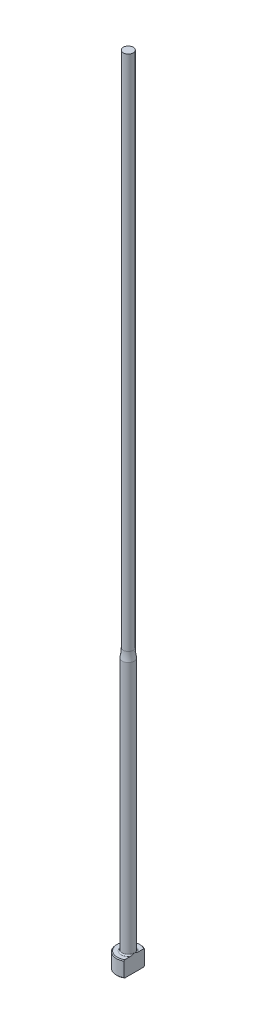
ISO-10303-21;
HEADER;
FILE_DESCRIPTION(('STEP AP214'),'2;1');
FILE_NAME('part.step','',(''),(''),'','','');
FILE_SCHEMA(('AUTOMOTIVE_DESIGN { 1 0 10303 214 1 1 1 1 }'));
ENDSEC;
DATA;
#1=APPLICATION_CONTEXT('core data for automotive mechanical design processes');
#2=APPLICATION_PROTOCOL_DEFINITION('international standard','automotive_design',2000,#1);
#3=PRODUCT_CONTEXT('',#1,'mechanical');
#4=PRODUCT('Part','Part','',(#3));
#5=PRODUCT_RELATED_PRODUCT_CATEGORY('part','',(#4));
#6=PRODUCT_DEFINITION_FORMATION('','',#4);
#7=PRODUCT_DEFINITION_CONTEXT('part definition',#1,'design');
#8=PRODUCT_DEFINITION('design','',#6,#7);
#9=PRODUCT_DEFINITION_SHAPE('','',#8);
#10=(LENGTH_UNIT() NAMED_UNIT(*) SI_UNIT(.MILLI.,.METRE.));
#11=(NAMED_UNIT(*) PLANE_ANGLE_UNIT() SI_UNIT($,.RADIAN.));
#12=(NAMED_UNIT(*) SI_UNIT($,.STERADIAN.) SOLID_ANGLE_UNIT());
#13=UNCERTAINTY_MEASURE_WITH_UNIT(LENGTH_MEASURE(1.E-05),#10,'distance_accuracy_value','');
#14=(GEOMETRIC_REPRESENTATION_CONTEXT(3) GLOBAL_UNCERTAINTY_ASSIGNED_CONTEXT((#13)) GLOBAL_UNIT_ASSIGNED_CONTEXT((#10,
#11,#12)) REPRESENTATION_CONTEXT('',''));
#15=CARTESIAN_POINT('',(0.,0.,0.));
#16=DIRECTION('',(0.,0.,1.));
#17=DIRECTION('',(1.,0.,0.));
#18=AXIS2_PLACEMENT_3D('',#15,#16,#17);
#19=CARTESIAN_POINT('',(-2.99999999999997,4.,0.));
#20=DIRECTION('',(0.,1.,0.));
#21=DIRECTION('',(0.,0.,1.));
#22=AXIS2_PLACEMENT_3D('',#19,#20,#21);
#23=PLANE('',#22);
#24=CARTESIAN_POINT('',(0.,4.,0.));
#25=DIRECTION('',(0.,1.,0.));
#26=DIRECTION('',(0.,0.,1.));
#27=AXIS2_PLACEMENT_3D('',#24,#25,#26);
#28=CIRCLE('',#27,2.79999999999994);
#29=CARTESIAN_POINT('',(1.49999999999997,4.,-2.36431808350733));
#30=VERTEX_POINT('',#29);
#31=CARTESIAN_POINT('',(1.49999999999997,4.,2.36431808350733));
#32=VERTEX_POINT('',#31);
#33=EDGE_CURVE('E187',#30,#32,#28,.T.);
#34=ORIENTED_EDGE('',*,*,#33,.T.);
#35=DIRECTION('',(0.,0.,-1.));
#36=VECTOR('',#35,1.);
#37=CARTESIAN_POINT('',(1.49999999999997,4.,0.));
#38=LINE('',#37,#36);
#39=CARTESIAN_POINT('',(1.49999999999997,4.00000000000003,0.994987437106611));
#40=VERTEX_POINT('',#39);
#41=EDGE_CURVE('E57',#32,#40,#38,.T.);
#42=ORIENTED_EDGE('',*,*,#41,.T.);
#43=CARTESIAN_POINT('',(0.,4.,0.));
#44=DIRECTION('',(0.,1.,0.));
#45=DIRECTION('',(0.,0.,1.));
#46=AXIS2_PLACEMENT_3D('',#43,#44,#45);
#47=CIRCLE('',#46,1.79999999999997);
#48=CARTESIAN_POINT('',(1.49999999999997,4.00000000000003,-0.994987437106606));
#49=VERTEX_POINT('',#48);
#50=EDGE_CURVE('E108',#40,#49,#47,.F.);
#51=ORIENTED_EDGE('',*,*,#50,.T.);
#52=EDGE_CURVE('E137',#49,#30,#38,.T.);
#53=ORIENTED_EDGE('',*,*,#52,.T.);
#54=EDGE_LOOP('',(#34,#42,#51,#53));
#55=FACE_BOUND('',#54,.T.);
#56=ADVANCED_FACE('F32',(#55),#23,.T.);
#57=CARTESIAN_POINT('',(0.,259.958771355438,0.));
#58=DIRECTION('',(0.,1.,0.));
#59=DIRECTION('',(0.,0.,1.));
#60=AXIS2_PLACEMENT_3D('',#57,#58,#59);
#61=CYLINDRICAL_SURFACE('',#60,2.99999999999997);
#62=CARTESIAN_POINT('',(0.,3.79999999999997,0.));
#63=DIRECTION('',(0.,1.,0.));
#64=DIRECTION('',(0.,0.,1.));
#65=AXIS2_PLACEMENT_3D('',#62,#63,#64);
#66=CIRCLE('',#65,2.99999999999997);
#67=CARTESIAN_POINT('',(1.49999999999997,3.79999999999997,2.5980762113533));
#68=VERTEX_POINT('',#67);
#69=CARTESIAN_POINT('',(1.49999999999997,3.79999999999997,-2.5980762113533));
#70=VERTEX_POINT('',#69);
#71=EDGE_CURVE('E105',#68,#70,#66,.F.);
#72=ORIENTED_EDGE('',*,*,#71,.T.);
#73=DIRECTION('',(0.,-1.,0.));
#74=VECTOR('',#73,1.);
#75=CARTESIAN_POINT('',(1.49999999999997,200.,-2.5980762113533));
#76=LINE('',#75,#74);
#77=CARTESIAN_POINT('',(1.49999999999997,0.200000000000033,-2.5980762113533));
#78=VERTEX_POINT('',#77);
#79=EDGE_CURVE('E193',#70,#78,#76,.T.);
#80=ORIENTED_EDGE('',*,*,#79,.T.);
#81=CARTESIAN_POINT('',(0.,0.200000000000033,0.));
#82=DIRECTION('',(0.,-1.,0.));
#83=DIRECTION('',(0.,0.,-1.));
#84=AXIS2_PLACEMENT_3D('',#81,#82,#83);
#85=CIRCLE('',#84,2.99999999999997);
#86=CARTESIAN_POINT('',(1.49999999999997,0.200000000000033,2.5980762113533));
#87=VERTEX_POINT('',#86);
#88=EDGE_CURVE('E100',#78,#87,#85,.F.);
#89=ORIENTED_EDGE('',*,*,#88,.T.);
#90=DIRECTION('',(0.,-1.,0.));
#91=VECTOR('',#90,1.);
#92=CARTESIAN_POINT('',(1.49999999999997,200.,2.5980762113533));
#93=LINE('',#92,#91);
#94=EDGE_CURVE('E93',#68,#87,#93,.T.);
#95=ORIENTED_EDGE('',*,*,#94,.F.);
#96=EDGE_LOOP('',(#72,#80,#89,#95));
#97=FACE_BOUND('',#96,.T.);
#98=ADVANCED_FACE('F158',(#97),#61,.T.);
#99=CARTESIAN_POINT('',(0.,0.,0.));
#100=DIRECTION('',(0.,-1.,0.));
#101=DIRECTION('',(0.,0.,-1.));
#102=AXIS2_PLACEMENT_3D('',#99,#100,#101);
#103=PLANE('',#102);
#104=CARTESIAN_POINT('',(0.,0.,0.));
#105=DIRECTION('',(0.,-1.,0.));
#106=DIRECTION('',(0.,0.,-1.));
#107=AXIS2_PLACEMENT_3D('',#104,#105,#106);
#108=CIRCLE('',#107,2.79999999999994);
#109=CARTESIAN_POINT('',(1.49999999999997,0.,2.36431808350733));
#110=VERTEX_POINT('',#109);
#111=CARTESIAN_POINT('',(1.49999999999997,0.,-2.36431808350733));
#112=VERTEX_POINT('',#111);
#113=EDGE_CURVE('E98',#110,#112,#108,.T.);
#114=ORIENTED_EDGE('',*,*,#113,.T.);
#115=DIRECTION('',(0.,0.,1.));
#116=VECTOR('',#115,1.);
#117=CARTESIAN_POINT('',(1.49999999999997,0.,2.5980762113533));
#118=LINE('',#117,#116);
#119=EDGE_CURVE('E83',#112,#110,#118,.T.);
#120=ORIENTED_EDGE('',*,*,#119,.T.);
#121=EDGE_LOOP('',(#114,#120));
#122=FACE_BOUND('',#121,.T.);
#123=ADVANCED_FACE('F103',(#122),#103,.T.);
#124=CARTESIAN_POINT('',(0.,4.,0.));
#125=DIRECTION('',(0.,-1.,0.));
#126=DIRECTION('',(0.,0.,-1.));
#127=AXIS2_PLACEMENT_3D('',#124,#125,#126);
#128=CONICAL_SURFACE('',#127,2.79999999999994,0.785398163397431);
#129=ORIENTED_EDGE('',*,*,#71,.F.);
#130=CARTESIAN_POINT('',(1.49999999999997,0.888258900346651,5.71827621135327));
#131=CARTESIAN_POINT('',(1.49999999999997,1.01361833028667,5.58866816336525));
#132=CARTESIAN_POINT('',(1.49999999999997,1.13884324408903,5.45892957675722));
#133=CARTESIAN_POINT('',(1.49999999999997,1.38894444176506,5.19911365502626));
#134=CARTESIAN_POINT('',(1.49999999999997,1.51382072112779,5.06903631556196));
#135=CARTESIAN_POINT('',(1.49999999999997,1.76320568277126,4.80840180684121));
#136=CARTESIAN_POINT('',(1.49999999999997,1.88771414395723,4.67784442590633));
#137=CARTESIAN_POINT('',(1.49999999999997,2.13618059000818,4.4162081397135));
#138=CARTESIAN_POINT('',(1.49999999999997,2.26013857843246,4.28512923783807));
#139=CARTESIAN_POINT('',(1.49999999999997,2.50488975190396,4.02490837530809));
#140=CARTESIAN_POINT('',(1.49999999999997,2.62569693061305,3.8957795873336));
#141=CARTESIAN_POINT('',(1.49999999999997,2.86640694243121,3.63668213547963));
#142=CARTESIAN_POINT('',(1.49999999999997,2.98630978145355,3.50671347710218));
#143=CARTESIAN_POINT('',(1.49999999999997,3.22486033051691,3.24567921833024));
#144=CARTESIAN_POINT('',(1.49999999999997,3.3435083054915,3.11461386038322));
#145=CARTESIAN_POINT('',(1.49999999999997,3.5790771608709,2.85094268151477));
#146=CARTESIAN_POINT('',(1.49999999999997,3.69599811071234,2.71833692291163));
#147=CARTESIAN_POINT('',(1.49999999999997,3.88262371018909,2.50255231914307));
#148=CARTESIAN_POINT('',(1.49999999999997,3.95312454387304,2.42006293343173));
#149=CARTESIAN_POINT('',(1.49999999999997,4.09287098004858,2.254010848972));
#150=CARTESIAN_POINT('',(1.49999999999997,4.16211645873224,2.17044804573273));
#151=CARTESIAN_POINT('',(1.49999999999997,4.29964684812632,2.00105967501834));
#152=CARTESIAN_POINT('',(1.49999999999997,4.36791386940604,1.9152195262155));
#153=CARTESIAN_POINT('',(1.49999999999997,4.50205840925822,1.7417139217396));
#154=CARTESIAN_POINT('',(1.49999999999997,4.56793649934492,1.65404891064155));
#155=CARTESIAN_POINT('',(1.49999999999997,4.69728151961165,1.47490236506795));
#156=CARTESIAN_POINT('',(1.49999999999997,4.76069661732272,1.38338308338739));
#157=CARTESIAN_POINT('',(1.49999999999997,4.88239539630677,1.19675661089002));
#158=CARTESIAN_POINT('',(1.49999999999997,4.94067201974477,1.10164473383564));
#159=CARTESIAN_POINT('',(1.49999999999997,5.048413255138,0.908008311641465));
#160=CARTESIAN_POINT('',(1.49999999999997,5.09797809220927,0.809540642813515));
#161=CARTESIAN_POINT('',(1.49999999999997,5.18432188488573,0.607192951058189));
#162=CARTESIAN_POINT('',(1.49999999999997,5.22114374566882,0.50333247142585));
#163=CARTESIAN_POINT('',(1.49999999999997,5.26099935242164,0.347577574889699));
#164=CARTESIAN_POINT('',(1.49999999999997,5.2715702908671,0.297609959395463));
#165=CARTESIAN_POINT('',(1.49999999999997,5.28794860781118,0.196885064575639));
#166=CARTESIAN_POINT('',(1.49999999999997,5.29375640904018,0.146127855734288));
#167=CARTESIAN_POINT('',(1.49999999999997,5.30019707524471,0.0444388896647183));
#168=CARTESIAN_POINT('',(1.49999999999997,5.30084594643,-0.00649183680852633));
#169=CARTESIAN_POINT('',(1.49999999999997,5.29696416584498,-0.108155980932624));
#170=CARTESIAN_POINT('',(1.49999999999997,5.29243308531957,-0.158889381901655));
#171=CARTESIAN_POINT('',(1.49999999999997,5.27856915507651,-0.259234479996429));
#172=CARTESIAN_POINT('',(1.49999999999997,5.2692782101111,-0.308852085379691));
#173=CARTESIAN_POINT('',(1.49999999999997,5.24647108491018,-0.407110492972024));
#174=CARTESIAN_POINT('',(1.49999999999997,5.23295324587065,-0.45575090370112));
#175=CARTESIAN_POINT('',(1.49999999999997,5.20226175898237,-0.55214996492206));
#176=CARTESIAN_POINT('',(1.49999999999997,5.18506801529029,-0.599902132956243));
#177=CARTESIAN_POINT('',(1.49999999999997,5.1477138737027,-0.694205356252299));
#178=CARTESIAN_POINT('',(1.49999999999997,5.12755408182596,-0.740756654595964));
#179=CARTESIAN_POINT('',(1.49999999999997,5.0632769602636,-0.879166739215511));
#180=CARTESIAN_POINT('',(1.49999999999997,5.01551721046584,-0.969329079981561));
#181=CARTESIAN_POINT('',(1.49999999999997,4.91367909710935,-1.14604316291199));
#182=CARTESIAN_POINT('',(1.49999999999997,4.85959300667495,-1.2325903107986));
#183=CARTESIAN_POINT('',(1.49999999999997,4.74697968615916,-1.40321348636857));
#184=CARTESIAN_POINT('',(1.49999999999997,4.68843573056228,-1.4872783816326));
#185=CARTESIAN_POINT('',(1.49999999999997,4.5684384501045,-1.65322187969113));
#186=CARTESIAN_POINT('',(1.49999999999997,4.50698656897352,-1.73510153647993));
#187=CARTESIAN_POINT('',(1.49999999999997,4.3811567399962,-1.89829823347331));
#188=CARTESIAN_POINT('',(1.49999999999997,4.31675092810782,-1.97959369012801));
#189=CARTESIAN_POINT('',(1.49999999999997,4.18634068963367,-2.14090082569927));
#190=CARTESIAN_POINT('',(1.49999999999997,4.12033609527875,-2.22091236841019));
#191=CARTESIAN_POINT('',(1.49999999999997,3.92086431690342,-2.45906508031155));
#192=CARTESIAN_POINT('',(1.49999999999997,3.78562663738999,-2.61572090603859));
#193=CARTESIAN_POINT('',(1.49999999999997,3.53554498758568,-2.90006295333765));
#194=CARTESIAN_POINT('',(1.49999999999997,3.42114543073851,-3.02814382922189));
#195=CARTESIAN_POINT('',(1.49999999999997,3.1909355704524,-3.28303767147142));
#196=CARTESIAN_POINT('',(1.49999999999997,3.07512522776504,-3.40985060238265));
#197=CARTESIAN_POINT('',(1.49999999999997,2.72597067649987,-3.78913849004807));
#198=CARTESIAN_POINT('',(1.49999999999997,2.49111760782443,-4.04022177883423));
#199=CARTESIAN_POINT('',(1.49999999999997,2.0288247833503,-4.52992803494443));
#200=CARTESIAN_POINT('',(1.49999999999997,1.80147747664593,-4.7686387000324));
#201=CARTESIAN_POINT('',(1.49999999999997,1.45954865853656,-5.12558036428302));
#202=CARTESIAN_POINT('',(1.49999999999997,1.34548484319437,-5.24430773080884));
#203=CARTESIAN_POINT('',(1.49999999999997,1.11707176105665,-5.48148573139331));
#204=CARTESIAN_POINT('',(1.49999999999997,1.00272249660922,-5.59993636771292));
#205=CARTESIAN_POINT('',(1.49999999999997,0.888258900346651,-5.71827621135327));
#206=B_SPLINE_CURVE_WITH_KNOTS('',3,(#130,#131,#132,#133,#134,#135,#136,#137,#138,#139,#140,
#141,#142,#143,#144,#145,#146,#147,#148,#149,#150,#151,#152,#153,#154,#155,#156,#157,#158,#159,
#160,#161,#162,#163,#164,#165,#166,#167,#168,#169,#170,#171,#172,#173,#174,#175,#176,#177,#178,
#179,#180,#181,#182,#183,#184,#185,#186,#187,#188,#189,#190,#191,#192,#193,#194,#195,#196,#197,
#198,#199,#200,#201,#202,#203,#204,#205),.UNSPECIFIED.,.F.,.F.,(4,2,2,2,2,2,2,2,2,2,2,2,2,2,2,2,
2,2,2,2,2,2,2,2,2,2,2,2,2,2,2,2,2,2,2,2,2,4),(0.,0.540943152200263,1.08189327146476,
1.62312052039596,2.16434426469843,2.69482920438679,3.22531067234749,3.75567781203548,
4.28602356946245,4.611550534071,4.9371094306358,5.26610945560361,5.59503024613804,
5.92894782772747,6.26331713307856,6.59354403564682,6.92264800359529,7.07567478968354,
7.22868799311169,7.38122626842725,7.53377717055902,7.68500755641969,7.83629736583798,
7.988436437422,8.14054446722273,8.44618799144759,8.75220879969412,9.05944044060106,
9.36652111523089,9.6776428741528,9.98879742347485,10.609592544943,11.1247803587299,
11.6399825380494,12.6713544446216,13.6603005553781,14.1542238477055,14.6481430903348),.UNSPECIFIED.);
#207=EDGE_CURVE('E136',#68,#32,#206,.T.);
#208=ORIENTED_EDGE('',*,*,#207,.T.);
#209=ORIENTED_EDGE('',*,*,#33,.F.);
#210=EDGE_CURVE('E128',#30,#70,#206,.T.);
#211=ORIENTED_EDGE('',*,*,#210,.T.);
#212=EDGE_LOOP('',(#129,#208,#209,#211));
#213=FACE_BOUND('',#212,.T.);
#214=ADVANCED_FACE('F144',(#213),#128,.T.);
#215=CARTESIAN_POINT('',(0.,0.200000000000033,0.));
#216=DIRECTION('',(0.,1.,0.));
#217=DIRECTION('',(0.,0.,1.));
#218=AXIS2_PLACEMENT_3D('',#215,#216,#217);
#219=CONICAL_SURFACE('',#218,2.99999999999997,0.785398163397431);
#220=ORIENTED_EDGE('',*,*,#88,.F.);
#221=CARTESIAN_POINT('',(1.49999999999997,3.11174109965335,-5.71827621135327));
#222=CARTESIAN_POINT('',(1.49999999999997,2.98638166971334,-5.58866816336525));
#223=CARTESIAN_POINT('',(1.49999999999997,2.86115675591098,-5.45892957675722));
#224=CARTESIAN_POINT('',(1.49999999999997,2.61105555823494,-5.19911365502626));
#225=CARTESIAN_POINT('',(1.49999999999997,2.48617927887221,-5.06903631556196));
#226=CARTESIAN_POINT('',(1.49999999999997,2.23679431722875,-4.80840180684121));
#227=CARTESIAN_POINT('',(1.49999999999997,2.11228585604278,-4.67784442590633));
#228=CARTESIAN_POINT('',(1.49999999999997,1.86381940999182,-4.4162081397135));
#229=CARTESIAN_POINT('',(1.49999999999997,1.73986142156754,-4.28512923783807));
#230=CARTESIAN_POINT('',(1.49999999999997,1.49511024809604,-4.02490837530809));
#231=CARTESIAN_POINT('',(1.49999999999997,1.37430306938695,-3.8957795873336));
#232=CARTESIAN_POINT('',(1.49999999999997,1.13359305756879,-3.63668213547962));
#233=CARTESIAN_POINT('',(1.49999999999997,1.01369021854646,-3.50671347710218));
#234=CARTESIAN_POINT('',(1.49999999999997,0.775139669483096,-3.24567921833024));
#235=CARTESIAN_POINT('',(1.49999999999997,0.656491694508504,-3.11461386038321));
#236=CARTESIAN_POINT('',(1.49999999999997,0.420922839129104,-2.85094268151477));
#237=CARTESIAN_POINT('',(1.49999999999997,0.304001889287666,-2.71833692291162));
#238=CARTESIAN_POINT('',(1.49999999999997,0.117376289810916,-2.50255231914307));
#239=CARTESIAN_POINT('',(1.49999999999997,0.0468754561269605,-2.42006293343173));
#240=CARTESIAN_POINT('',(1.49999999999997,-0.0928709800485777,-2.254010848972));
#241=CARTESIAN_POINT('',(1.49999999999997,-0.162116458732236,-2.17044804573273));
#242=CARTESIAN_POINT('',(1.49999999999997,-0.299646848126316,-2.00105967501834));
#243=CARTESIAN_POINT('',(1.49999999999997,-0.367913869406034,-1.9152195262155));
#244=CARTESIAN_POINT('',(1.49999999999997,-0.502058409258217,-1.7417139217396));
#245=CARTESIAN_POINT('',(1.49999999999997,-0.567936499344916,-1.65404891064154));
#246=CARTESIAN_POINT('',(1.49999999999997,-0.697281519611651,-1.47490236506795));
#247=CARTESIAN_POINT('',(1.49999999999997,-0.760696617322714,-1.38338308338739));
#248=CARTESIAN_POINT('',(1.49999999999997,-0.882395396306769,-1.19675661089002));
#249=CARTESIAN_POINT('',(1.49999999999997,-0.940672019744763,-1.10164473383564));
#250=CARTESIAN_POINT('',(1.49999999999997,-1.048413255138,-0.908008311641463));
#251=CARTESIAN_POINT('',(1.49999999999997,-1.09797809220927,-0.809540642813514));
#252=CARTESIAN_POINT('',(1.49999999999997,-1.18432188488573,-0.607192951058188));
#253=CARTESIAN_POINT('',(1.49999999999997,-1.22114374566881,-0.503332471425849));
#254=CARTESIAN_POINT('',(1.49999999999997,-1.26099935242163,-0.347577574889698));
#255=CARTESIAN_POINT('',(1.49999999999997,-1.2715702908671,-0.297609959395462));
#256=CARTESIAN_POINT('',(1.49999999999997,-1.28794860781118,-0.196885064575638));
#257=CARTESIAN_POINT('',(1.49999999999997,-1.29375640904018,-0.146127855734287));
#258=CARTESIAN_POINT('',(1.49999999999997,-1.30019707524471,-0.0444388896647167));
#259=CARTESIAN_POINT('',(1.49999999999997,-1.30084594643,0.00649183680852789));
#260=CARTESIAN_POINT('',(1.49999999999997,-1.29696416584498,0.108155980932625));
#261=CARTESIAN_POINT('',(1.49999999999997,-1.29243308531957,0.158889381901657));
#262=CARTESIAN_POINT('',(1.49999999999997,-1.2785691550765,0.259234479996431));
#263=CARTESIAN_POINT('',(1.49999999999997,-1.2692782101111,0.308852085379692));
#264=CARTESIAN_POINT('',(1.49999999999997,-1.24647108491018,0.407110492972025));
#265=CARTESIAN_POINT('',(1.49999999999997,-1.23295324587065,0.455750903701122));
#266=CARTESIAN_POINT('',(1.49999999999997,-1.20226175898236,0.552149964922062));
#267=CARTESIAN_POINT('',(1.49999999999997,-1.18506801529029,0.599902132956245));
#268=CARTESIAN_POINT('',(1.49999999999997,-1.14771387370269,0.694205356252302));
#269=CARTESIAN_POINT('',(1.49999999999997,-1.12755408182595,0.740756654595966));
#270=CARTESIAN_POINT('',(1.49999999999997,-1.0632769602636,0.879166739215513));
#271=CARTESIAN_POINT('',(1.49999999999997,-1.01551721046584,0.969329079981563));
#272=CARTESIAN_POINT('',(1.49999999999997,-0.913679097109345,1.14604316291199));
#273=CARTESIAN_POINT('',(1.49999999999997,-0.859593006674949,1.2325903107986));
#274=CARTESIAN_POINT('',(1.49999999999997,-0.746979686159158,1.40321348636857));
#275=CARTESIAN_POINT('',(1.49999999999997,-0.688435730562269,1.4872783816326));
#276=CARTESIAN_POINT('',(1.49999999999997,-0.568438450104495,1.65322187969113));
#277=CARTESIAN_POINT('',(1.49999999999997,-0.506986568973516,1.73510153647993));
#278=CARTESIAN_POINT('',(1.49999999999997,-0.381156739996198,1.89829823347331));
#279=CARTESIAN_POINT('',(1.49999999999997,-0.316750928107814,1.97959369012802));
#280=CARTESIAN_POINT('',(1.49999999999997,-0.186340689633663,2.14090082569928));
#281=CARTESIAN_POINT('',(1.49999999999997,-0.12033609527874,2.22091236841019));
#282=CARTESIAN_POINT('',(1.49999999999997,0.0791356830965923,2.45906508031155));
#283=CARTESIAN_POINT('',(1.49999999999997,0.214373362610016,2.61572090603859));
#284=CARTESIAN_POINT('',(1.49999999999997,0.46445501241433,2.90006295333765));
#285=CARTESIAN_POINT('',(1.49999999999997,0.578854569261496,3.02814382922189));
#286=CARTESIAN_POINT('',(1.49999999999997,0.809064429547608,3.28303767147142));
#287=CARTESIAN_POINT('',(1.49999999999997,0.924874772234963,3.40985060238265));
#288=CARTESIAN_POINT('',(1.49999999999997,1.27402932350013,3.78913849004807));
#289=CARTESIAN_POINT('',(1.49999999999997,1.50888239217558,4.04022177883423));
#290=CARTESIAN_POINT('',(1.49999999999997,1.97117521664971,4.52992803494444));
#291=CARTESIAN_POINT('',(1.49999999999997,2.19852252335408,4.76863870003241));
#292=CARTESIAN_POINT('',(1.49999999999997,2.54045134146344,5.12558036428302));
#293=CARTESIAN_POINT('',(1.49999999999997,2.65451515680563,5.24430773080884));
#294=CARTESIAN_POINT('',(1.49999999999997,2.88292823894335,5.48148573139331));
#295=CARTESIAN_POINT('',(1.49999999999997,2.99727750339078,5.59993636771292));
#296=CARTESIAN_POINT('',(1.49999999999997,3.11174109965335,5.71827621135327));
#297=B_SPLINE_CURVE_WITH_KNOTS('',3,(#221,#222,#223,#224,#225,#226,#227,#228,#229,#230,#231,
#232,#233,#234,#235,#236,#237,#238,#239,#240,#241,#242,#243,#244,#245,#246,#247,#248,#249,#250,
#251,#252,#253,#254,#255,#256,#257,#258,#259,#260,#261,#262,#263,#264,#265,#266,#267,#268,#269,
#270,#271,#272,#273,#274,#275,#276,#277,#278,#279,#280,#281,#282,#283,#284,#285,#286,#287,#288,
#289,#290,#291,#292,#293,#294,#295,#296),.UNSPECIFIED.,.F.,.F.,(4,2,2,2,2,2,2,2,2,2,2,2,2,2,2,2,
2,2,2,2,2,2,2,2,2,2,2,2,2,2,2,2,2,2,2,2,2,4),(0.,0.540943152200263,1.08189327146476,
1.62312052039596,2.16434426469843,2.69482920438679,3.22531067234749,3.75567781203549,
4.28602356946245,4.611550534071,4.9371094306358,5.26610945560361,5.59503024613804,
5.92894782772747,6.26331713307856,6.59354403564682,6.92264800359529,7.07567478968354,
7.2286879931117,7.38122626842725,7.53377717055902,7.6850075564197,7.83629736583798,
7.98843643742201,8.14054446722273,8.44618799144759,8.75220879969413,9.05944044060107,
9.3665211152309,9.6776428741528,9.98879742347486,10.609592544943,11.1247803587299,
11.6399825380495,12.6713544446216,13.6603005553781,14.1542238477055,14.6481430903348),.UNSPECIFIED.);
#298=EDGE_CURVE('E86',#78,#112,#297,.T.);
#299=ORIENTED_EDGE('',*,*,#298,.T.);
#300=ORIENTED_EDGE('',*,*,#113,.F.);
#301=EDGE_CURVE('E89',#110,#87,#297,.T.);
#302=ORIENTED_EDGE('',*,*,#301,.T.);
#303=EDGE_LOOP('',(#220,#299,#300,#302));
#304=FACE_BOUND('',#303,.T.);
#305=ADVANCED_FACE('F97',(#304),#219,.T.);
#306=CARTESIAN_POINT('',(0.,4.30000000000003,0.));
#307=DIRECTION('',(0.,1.,0.));
#308=DIRECTION('',(0.,0.,1.));
#309=AXIS2_PLACEMENT_3D('',#306,#307,#308);
#310=TOROIDAL_SURFACE('',#309,1.79999999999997,0.3);
#311=CARTESIAN_POINT('',(1.49999999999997,4.30000000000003,0.));
#312=CARTESIAN_POINT('',(1.49999999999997,4.30000063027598,3.41945444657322E-12));
#313=CARTESIAN_POINT('',(1.49999999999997,4.30000126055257,-1.15373636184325E-07));
#314=CARTESIAN_POINT('',(1.49999999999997,4.30000248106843,-4.90631569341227E-07));
#315=CARTESIAN_POINT('',(1.49999999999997,4.30000307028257,-7.53296664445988E-07));
#316=CARTESIAN_POINT('',(1.49999999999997,4.30000424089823,-1.38757095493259E-06));
#317=CARTESIAN_POINT('',(1.49999999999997,4.30000481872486,-1.76563000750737E-06));
#318=CARTESIAN_POINT('',(1.49999999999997,4.30000591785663,-2.58768006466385E-06));
#319=CARTESIAN_POINT('',(1.49999999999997,4.30000643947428,-3.03127013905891E-06));
#320=CARTESIAN_POINT('',(1.49999999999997,4.30000815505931,-4.60021967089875E-06));
#321=CARTESIAN_POINT('',(1.49999999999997,4.30000927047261,-5.81241520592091E-06));
#322=CARTESIAN_POINT('',(1.49999999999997,4.30001128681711,-8.33989414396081E-06));
#323=CARTESIAN_POINT('',(1.49999999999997,4.30001219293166,-9.65128158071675E-06));
#324=CARTESIAN_POINT('',(1.49999999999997,4.30001551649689,-1.46782506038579E-05));
#325=CARTESIAN_POINT('',(1.49999999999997,4.30001775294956,-1.85179769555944E-05));
#326=CARTESIAN_POINT('',(1.49999999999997,4.30002148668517,-2.61616194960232E-05));
#327=CARTESIAN_POINT('',(1.49999999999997,4.30002302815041,-2.99447742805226E-05));
#328=CARTESIAN_POINT('',(1.49999999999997,4.30002943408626,-4.58003745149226E-05));
#329=CARTESIAN_POINT('',(1.49999999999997,4.3000341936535,-5.79079080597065E-05));
#330=CARTESIAN_POINT('',(1.49999999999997,4.30004197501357,-8.07263758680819E-05));
#331=CARTESIAN_POINT('',(1.49999999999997,4.30004514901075,-9.13834712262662E-05));
#332=CARTESIAN_POINT('',(1.49999999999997,4.30006989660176,-0.000167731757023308));
#333=CARTESIAN_POINT('',(1.49999999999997,4.30010092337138,-0.000229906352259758));
#334=CARTESIAN_POINT('',(1.49999999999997,4.30021632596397,-0.000470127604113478));
#335=CARTESIAN_POINT('',(1.49999999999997,4.30029368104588,-0.000650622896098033));
#336=CARTESIAN_POINT('',(1.49999999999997,4.30059619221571,-0.00134589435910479));
#337=CARTESIAN_POINT('',(1.49999999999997,4.30082870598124,-0.00185814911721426));
#338=CARTESIAN_POINT('',(1.49999999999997,4.30176696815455,-0.0039354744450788));
#339=CARTESIAN_POINT('',(1.49999999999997,4.30246445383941,-0.00550332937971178));
#340=CARTESIAN_POINT('',(1.49999999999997,4.31426785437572,-0.0320229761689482));
#341=CARTESIAN_POINT('',(1.49999999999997,4.3254480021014,-0.0569503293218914));
#342=CARTESIAN_POINT('',(1.49999999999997,4.34725700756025,-0.105984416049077));
#343=CARTESIAN_POINT('',(1.49999999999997,4.35789134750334,-0.130088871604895));
#344=CARTESIAN_POINT('',(1.49999999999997,4.38015321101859,-0.181096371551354));
#345=CARTESIAN_POINT('',(1.49999999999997,4.39175804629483,-0.208009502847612));
#346=CARTESIAN_POINT('',(1.49999999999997,4.41469034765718,-0.262264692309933));
#347=CARTESIAN_POINT('',(1.49999999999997,4.42601398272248,-0.289608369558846));
#348=CARTESIAN_POINT('',(1.49999999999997,4.45363212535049,-0.358203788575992));
#349=CARTESIAN_POINT('',(1.49999999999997,4.46959026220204,-0.399592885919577));
#350=CARTESIAN_POINT('',(1.49999999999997,4.49940505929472,-0.48209793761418));
#351=CARTESIAN_POINT('',(1.49999999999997,4.51330033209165,-0.523199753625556));
#352=CARTESIAN_POINT('',(1.49999999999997,4.53552507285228,-0.595497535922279));
#353=CARTESIAN_POINT('',(1.49999999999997,4.54436834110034,-0.626532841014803));
#354=CARTESIAN_POINT('',(1.49999999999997,4.56052427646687,-0.689176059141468));
#355=CARTESIAN_POINT('',(1.49999999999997,4.56782794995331,-0.720786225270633));
#356=CARTESIAN_POINT('',(1.49999999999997,4.5875075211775,-0.819524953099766));
#357=CARTESIAN_POINT('',(1.49999999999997,4.59661044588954,-0.887429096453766));
#358=CARTESIAN_POINT('',(1.49999999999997,4.60059842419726,-0.991180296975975));
#359=CARTESIAN_POINT('',(1.49999999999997,4.60019840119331,-1.02684364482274));
#360=CARTESIAN_POINT('',(1.49999999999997,4.59497085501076,-1.09750559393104));
#361=CARTESIAN_POINT('',(1.49999999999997,4.59019295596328,-1.13250716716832));
#362=CARTESIAN_POINT('',(1.49999999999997,4.57687734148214,-1.19353096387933));
#363=CARTESIAN_POINT('',(1.49999999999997,4.56943875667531,-1.21978854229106));
#364=CARTESIAN_POINT('',(1.49999999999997,4.55063748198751,-1.27094658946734));
#365=CARTESIAN_POINT('',(1.49999999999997,4.53927342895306,-1.29584658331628));
#366=CARTESIAN_POINT('',(1.49999999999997,4.51660016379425,-1.33501873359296));
#367=CARTESIAN_POINT('',(1.49999999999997,4.50657738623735,-1.35003296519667));
#368=CARTESIAN_POINT('',(1.49999999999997,4.48437469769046,-1.37837252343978));
#369=CARTESIAN_POINT('',(1.49999999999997,4.47219867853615,-1.3917008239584));
#370=CARTESIAN_POINT('',(1.49999999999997,4.4483561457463,-1.4134941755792));
#371=CARTESIAN_POINT('',(1.49999999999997,4.43709185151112,-1.42239673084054));
#372=CARTESIAN_POINT('',(1.49999999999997,4.41325256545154,-1.43825467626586));
#373=CARTESIAN_POINT('',(1.49999999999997,4.40067804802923,-1.44521076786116));
#374=CARTESIAN_POINT('',(1.49999999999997,4.37433767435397,-1.45677158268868));
#375=CARTESIAN_POINT('',(1.49999999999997,4.36056203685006,-1.46135438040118));
#376=CARTESIAN_POINT('',(1.49999999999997,4.33237324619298,-1.46767730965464));
#377=CARTESIAN_POINT('',(1.49999999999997,4.3179607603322,-1.46942034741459));
#378=CARTESIAN_POINT('',(1.49999999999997,4.29122479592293,-1.4698720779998));
#379=CARTESIAN_POINT('',(1.49999999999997,4.27890664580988,-1.468990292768));
#380=CARTESIAN_POINT('',(1.49999999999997,4.25461019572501,-1.4651157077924));
#381=CARTESIAN_POINT('',(1.49999999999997,4.24263187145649,-1.46212305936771));
#382=CARTESIAN_POINT('',(1.49999999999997,4.21959683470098,-1.4543117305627));
#383=CARTESIAN_POINT('',(1.49999999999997,4.20852542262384,-1.44953579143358));
#384=CARTESIAN_POINT('',(1.49999999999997,4.18721125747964,-1.43840957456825));
#385=CARTESIAN_POINT('',(1.49999999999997,4.17696878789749,-1.43205876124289));
#386=CARTESIAN_POINT('',(1.49999999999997,4.15325976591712,-1.41506353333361));
#387=CARTESIAN_POINT('',(1.49999999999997,4.14027750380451,-1.40374235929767));
#388=CARTESIAN_POINT('',(1.49999999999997,4.11630720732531,-1.37914825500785));
#389=CARTESIAN_POINT('',(1.49999999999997,4.10532420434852,-1.36587054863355));
#390=CARTESIAN_POINT('',(1.49999999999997,4.08100891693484,-1.33197272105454));
#391=CARTESIAN_POINT('',(1.49999999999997,4.06867625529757,-1.31063843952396));
#392=CARTESIAN_POINT('',(1.49999999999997,4.04751867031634,-1.26637455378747));
#393=CARTESIAN_POINT('',(1.49999999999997,4.03869240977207,-1.24344556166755));
#394=CARTESIAN_POINT('',(1.49999999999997,4.01978360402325,-1.18316534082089));
#395=CARTESIAN_POINT('',(1.49999999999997,4.01191472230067,-1.14512623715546));
#396=CARTESIAN_POINT('',(1.49999999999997,4.00188285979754,-1.06789971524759));
#397=CARTESIAN_POINT('',(1.49999999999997,3.99979735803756,-1.02870374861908));
#398=CARTESIAN_POINT('',(1.49999999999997,4.00021727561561,-0.953160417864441));
#399=CARTESIAN_POINT('',(1.49999999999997,4.00240673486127,-0.916808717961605));
#400=CARTESIAN_POINT('',(1.49999999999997,4.00996433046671,-0.844432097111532));
#401=CARTESIAN_POINT('',(1.49999999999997,4.01533462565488,-0.808407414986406));
#402=CARTESIAN_POINT('',(1.49999999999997,4.02828086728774,-0.738670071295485));
#403=CARTESIAN_POINT('',(1.49999999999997,4.03573028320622,-0.704933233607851));
#404=CARTESIAN_POINT('',(1.49999999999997,4.05243174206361,-0.638128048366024));
#405=CARTESIAN_POINT('',(1.49999999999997,4.06167285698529,-0.605056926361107));
#406=CARTESIAN_POINT('',(1.49999999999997,4.08440652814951,-0.530195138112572));
#407=CARTESIAN_POINT('',(1.49999999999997,4.0983657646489,-0.488547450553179));
#408=CARTESIAN_POINT('',(1.49999999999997,4.12838209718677,-0.404954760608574));
#409=CARTESIAN_POINT('',(1.49999999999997,4.14447968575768,-0.36302453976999));
#410=CARTESIAN_POINT('',(1.49999999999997,4.17238454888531,-0.293508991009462));
#411=CARTESIAN_POINT('',(1.49999999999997,4.18384249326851,-0.265781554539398));
#412=CARTESIAN_POINT('',(1.49999999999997,4.20705854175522,-0.210769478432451));
#413=CARTESIAN_POINT('',(1.49999999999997,4.21881265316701,-0.183483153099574));
#414=CARTESIAN_POINT('',(1.49999999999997,4.24136702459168,-0.131772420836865));
#415=CARTESIAN_POINT('',(1.49999999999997,4.25214361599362,-0.10733750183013));
#416=CARTESIAN_POINT('',(1.49999999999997,4.27424746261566,-0.0576321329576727));
#417=CARTESIAN_POINT('',(1.49999999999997,4.28558038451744,-0.0323640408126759));
#418=CARTESIAN_POINT('',(1.49999999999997,4.29753556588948,-0.00550327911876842));
#419=CARTESIAN_POINT('',(1.49999999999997,4.29823307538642,-0.00393537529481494));
#420=CARTESIAN_POINT('',(1.49999999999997,4.2991713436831,-0.00185803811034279));
#421=CARTESIAN_POINT('',(1.49999999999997,4.29940384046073,-0.00134582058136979));
#422=CARTESIAN_POINT('',(1.49999999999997,4.29970633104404,-0.000650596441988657));
#423=CARTESIAN_POINT('',(1.49999999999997,4.29978368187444,-0.000470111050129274));
#424=CARTESIAN_POINT('',(1.49999999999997,4.29989907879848,-0.000229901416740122));
#425=CARTESIAN_POINT('',(1.49999999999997,4.29993010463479,-0.000167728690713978));
#426=CARTESIAN_POINT('',(1.49999999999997,4.29995485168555,-9.13825695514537E-05));
#427=CARTESIAN_POINT('',(1.49999999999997,4.29995802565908,-8.07256246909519E-05));
#428=CARTESIAN_POINT('',(1.49999999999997,4.29996580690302,-5.79074825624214E-05));
#429=CARTESIAN_POINT('',(1.49999999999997,4.29997056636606,-4.58001201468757E-05));
#430=CARTESIAN_POINT('',(1.49999999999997,4.29997697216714,-2.99447122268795E-05));
#431=CARTESIAN_POINT('',(1.49999999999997,4.29997851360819,-2.61615819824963E-05));
#432=CARTESIAN_POINT('',(1.49999999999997,4.29998224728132,-1.85179847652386E-05));
#433=CARTESIAN_POINT('',(1.49999999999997,4.29998448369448,-1.46782784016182E-05));
#434=CARTESIAN_POINT('',(1.49999999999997,4.29998780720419,-9.65132765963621E-06));
#435=CARTESIAN_POINT('',(1.49999999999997,4.29998871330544,-8.33994215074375E-06));
#436=CARTESIAN_POINT('',(1.49999999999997,4.29999072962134,-5.81246437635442E-06));
#437=CARTESIAN_POINT('',(1.49999999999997,4.29999184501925,-4.60026797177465E-06));
#438=CARTESIAN_POINT('',(1.49999999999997,4.29999356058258,-3.03131401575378E-06));
#439=CARTESIAN_POINT('',(1.49999999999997,4.29999408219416,-2.5877220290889E-06));
#440=CARTESIAN_POINT('',(1.49999999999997,4.29999518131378,-1.76566706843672E-06));
#441=CARTESIAN_POINT('',(1.49999999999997,4.29999575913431,-1.38760501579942E-06));
#442=CARTESIAN_POINT('',(1.49999999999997,4.29999692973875,-7.53323456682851E-07));
#443=CARTESIAN_POINT('',(1.49999999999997,4.29999751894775,-4.9065421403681E-07));
#444=CARTESIAN_POINT('',(1.49999999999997,4.2999987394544,-1.15386277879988E-07));
#445=CARTESIAN_POINT('',(1.49999999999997,4.2999993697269,-3.41943909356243E-12));
#446=CARTESIAN_POINT('',(1.49999999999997,4.30000000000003,0.));
#447=B_SPLINE_CURVE_WITH_KNOTS('',3,(#311,#312,#313,#314,#315,#316,#317,#318,#319,#320,#321,
#322,#323,#324,#325,#326,#327,#328,#329,#330,#331,#332,#333,#334,#335,#336,#337,#338,#339,#340,
#341,#342,#343,#344,#345,#346,#347,#348,#349,#350,#351,#352,#353,#354,#355,#356,#357,#358,#359,
#360,#361,#362,#363,#364,#365,#366,#367,#368,#369,#370,#371,#372,#373,#374,#375,#376,#377,#378,
#379,#380,#381,#382,#383,#384,#385,#386,#387,#388,#389,#390,#391,#392,#393,#394,#395,#396,#397,
#398,#399,#400,#401,#402,#403,#404,#405,#406,#407,#408,#409,#410,#411,#412,#413,#414,#415,#416,
#417,#418,#419,#420,#421,#422,#423,#424,#425,#426,#427,#428,#429,#430,#431,#432,#433,#434,#435,
#436,#437,#438,#439,#440,#441,#442,#443,#444,#445,#446),.UNSPECIFIED.,.T.,.F.,(4,2,2,2,2,2,2,2,
2,2,2,2,2,2,2,2,2,2,2,2,2,2,2,2,2,2,2,2,2,2,2,2,2,2,2,2,2,2,2,2,2,2,2,2,2,2,2,2,2,2,2,2,2,2,2,2,
2,2,2,2,2,2,2,2,2,2,2,4),(0.,1.88906030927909E-06,3.81509580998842E-06,5.87892822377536E-06,
7.93062004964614E-06,1.28480887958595E-05,1.76261714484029E-05,3.0909918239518E-05,
4.31529746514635E-05,8.2169932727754E-05,0.000115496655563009,0.000323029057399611,
0.000912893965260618,0.00259963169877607,0.00774858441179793,0.0896975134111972,
0.168737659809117,0.256660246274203,0.345444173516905,0.478492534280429,0.60860395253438,
0.705372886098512,0.802692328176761,1.00719557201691,1.11399616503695,1.21960092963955,
1.30124317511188,1.38291380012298,1.43690814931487,1.49080588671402,1.53371524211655,
1.57660911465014,1.61989249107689,1.66313154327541,1.69999492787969,1.73685567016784,
1.77288440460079,1.80892540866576,1.86031324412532,1.91182866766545,1.98534297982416,
2.05882922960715,2.17471722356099,2.29215041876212,2.40123170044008,2.51038710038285,
2.61397263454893,2.71694519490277,2.84866234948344,2.98337525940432,3.07337666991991,
3.16250453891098,3.24262397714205,3.3256930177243,3.33084213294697,3.33252874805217,
3.33311858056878,3.33332610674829,3.33335943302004,3.33339844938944,3.3334106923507,
3.3334239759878,3.33342875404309,3.33343367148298,3.33343572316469,3.33343778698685,
3.33343971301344,3.33344160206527),.UNSPECIFIED.);
#448=CARTESIAN_POINT('',(1.49999999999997,4.30000000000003,0.));
#449=VERTEX_POINT('',#448);
#450=EDGE_CURVE('E11',#49,#449,#447,.T.);
#451=ORIENTED_EDGE('',*,*,#450,.F.);
#452=ORIENTED_EDGE('',*,*,#50,.F.);
#453=CARTESIAN_POINT('',(1.49999999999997,4.30000000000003,0.));
#454=CARTESIAN_POINT('',(1.49999999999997,4.29999936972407,-3.4196040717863E-12));
#455=CARTESIAN_POINT('',(1.49999999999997,4.29999873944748,1.15373635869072E-07));
#456=CARTESIAN_POINT('',(1.49999999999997,4.29999751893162,4.90631569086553E-07));
#457=CARTESIAN_POINT('',(1.49999999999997,4.29999692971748,7.53296664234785E-07));
#458=CARTESIAN_POINT('',(1.49999999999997,4.29999575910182,1.38757095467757E-06));
#459=CARTESIAN_POINT('',(1.49999999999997,4.2999951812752,1.76563000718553E-06));
#460=CARTESIAN_POINT('',(1.49999999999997,4.29999408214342,2.58768006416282E-06));
#461=CARTESIAN_POINT('',(1.49999999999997,4.29999356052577,3.03127013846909E-06));
#462=CARTESIAN_POINT('',(1.49999999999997,4.29999184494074,4.60021967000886E-06));
#463=CARTESIAN_POINT('',(1.49999999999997,4.29999072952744,5.81241520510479E-06));
#464=CARTESIAN_POINT('',(1.49999999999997,4.29998871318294,8.33989414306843E-06));
#465=CARTESIAN_POINT('',(1.49999999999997,4.29998780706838,9.65128157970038E-06));
#466=CARTESIAN_POINT('',(1.49999999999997,4.29998448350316,1.46782506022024E-05));
#467=CARTESIAN_POINT('',(1.49999999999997,4.29998224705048,1.85179769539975E-05));
#468=CARTESIAN_POINT('',(1.49999999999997,4.29997851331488,2.61616194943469E-05));
#469=CARTESIAN_POINT('',(1.49999999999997,4.29997697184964,2.99447742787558E-05));
#470=CARTESIAN_POINT('',(1.49999999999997,4.29997056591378,4.58003745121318E-05));
#471=CARTESIAN_POINT('',(1.49999999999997,4.29996580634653,5.7907908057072E-05));
#472=CARTESIAN_POINT('',(1.49999999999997,4.29995802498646,8.07263758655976E-05));
#473=CARTESIAN_POINT('',(1.49999999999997,4.29995485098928,9.13834712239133E-05));
#474=CARTESIAN_POINT('',(1.49999999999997,4.29993010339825,0.000167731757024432));
#475=CARTESIAN_POINT('',(1.49999999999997,4.29989907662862,0.000229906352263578));
#476=CARTESIAN_POINT('',(1.49999999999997,4.29978367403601,0.000470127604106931));
#477=CARTESIAN_POINT('',(1.49999999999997,4.29970631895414,0.000650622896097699));
#478=CARTESIAN_POINT('',(1.49999999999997,4.2994038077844,0.00134589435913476));
#479=CARTESIAN_POINT('',(1.49999999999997,4.29917129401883,0.00185814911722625));
#480=CARTESIAN_POINT('',(1.49999999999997,4.29823303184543,0.00393547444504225));
#481=CARTESIAN_POINT('',(1.49999999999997,4.29753554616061,0.00550332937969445));
#482=CARTESIAN_POINT('',(1.49999999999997,4.28573214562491,0.0320229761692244));
#483=CARTESIAN_POINT('',(1.49999999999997,4.2745519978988,0.0569503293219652));
#484=CARTESIAN_POINT('',(1.49999999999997,4.25274299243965,0.105984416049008));
#485=CARTESIAN_POINT('',(1.49999999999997,4.24210865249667,0.130088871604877));
#486=CARTESIAN_POINT('',(1.49999999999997,4.21984678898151,0.181096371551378));
#487=CARTESIAN_POINT('',(1.49999999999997,4.20824195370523,0.208009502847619));
#488=CARTESIAN_POINT('',(1.49999999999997,4.18530965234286,0.262264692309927));
#489=CARTESIAN_POINT('',(1.49999999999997,4.17398601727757,0.289608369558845));
#490=CARTESIAN_POINT('',(1.49999999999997,4.14636787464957,0.358203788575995));
#491=CARTESIAN_POINT('',(1.49999999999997,4.13040973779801,0.399592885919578));
#492=CARTESIAN_POINT('',(1.49999999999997,4.10059494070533,0.48209793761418));
#493=CARTESIAN_POINT('',(1.49999999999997,4.0866996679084,0.523199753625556));
#494=CARTESIAN_POINT('',(1.49999999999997,4.06447492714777,0.595497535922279));
#495=CARTESIAN_POINT('',(1.49999999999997,4.05563165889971,0.626532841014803));
#496=CARTESIAN_POINT('',(1.49999999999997,4.03947572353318,0.689176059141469));
#497=CARTESIAN_POINT('',(1.49999999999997,4.03217205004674,0.720786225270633));
#498=CARTESIAN_POINT('',(1.49999999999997,4.01249247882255,0.819524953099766));
#499=CARTESIAN_POINT('',(1.49999999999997,4.00338955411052,0.887429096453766));
#500=CARTESIAN_POINT('',(1.49999999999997,3.99940157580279,0.991180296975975));
#501=CARTESIAN_POINT('',(1.49999999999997,3.99980159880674,1.02684364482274));
#502=CARTESIAN_POINT('',(1.49999999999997,4.0050291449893,1.09750559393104));
#503=CARTESIAN_POINT('',(1.49999999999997,4.00980704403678,1.13250716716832));
#504=CARTESIAN_POINT('',(1.49999999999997,4.02312265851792,1.19353096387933));
#505=CARTESIAN_POINT('',(1.49999999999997,4.03056124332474,1.21978854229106));
#506=CARTESIAN_POINT('',(1.49999999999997,4.04936251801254,1.27094658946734));
#507=CARTESIAN_POINT('',(1.49999999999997,4.06072657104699,1.29584658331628));
#508=CARTESIAN_POINT('',(1.49999999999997,4.0833998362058,1.33501873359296));
#509=CARTESIAN_POINT('',(1.49999999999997,4.0934226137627,1.35003296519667));
#510=CARTESIAN_POINT('',(1.49999999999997,4.1156253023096,1.37837252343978));
#511=CARTESIAN_POINT('',(1.49999999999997,4.1278013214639,1.3917008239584));
#512=CARTESIAN_POINT('',(1.49999999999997,4.15164385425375,1.4134941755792));
#513=CARTESIAN_POINT('',(1.49999999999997,4.16290814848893,1.42239673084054));
#514=CARTESIAN_POINT('',(1.49999999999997,4.18674743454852,1.43825467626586));
#515=CARTESIAN_POINT('',(1.49999999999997,4.19932195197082,1.44521076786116));
#516=CARTESIAN_POINT('',(1.49999999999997,4.22566232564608,1.45677158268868));
#517=CARTESIAN_POINT('',(1.49999999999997,4.23943796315,1.46135438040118));
#518=CARTESIAN_POINT('',(1.49999999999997,4.26762675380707,1.46767730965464));
#519=CARTESIAN_POINT('',(1.49999999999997,4.28203923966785,1.46942034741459));
#520=CARTESIAN_POINT('',(1.49999999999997,4.30877520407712,1.4698720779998));
#521=CARTESIAN_POINT('',(1.49999999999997,4.32109335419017,1.468990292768));
#522=CARTESIAN_POINT('',(1.49999999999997,4.34538980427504,1.4651157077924));
#523=CARTESIAN_POINT('',(1.49999999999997,4.35736812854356,1.46212305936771));
#524=CARTESIAN_POINT('',(1.49999999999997,4.38040316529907,1.4543117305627));
#525=CARTESIAN_POINT('',(1.49999999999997,4.39147457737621,1.44953579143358));
#526=CARTESIAN_POINT('',(1.49999999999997,4.41278874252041,1.43840957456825));
#527=CARTESIAN_POINT('',(1.49999999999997,4.42303121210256,1.43205876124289));
#528=CARTESIAN_POINT('',(1.49999999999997,4.44674023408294,1.41506353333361));
#529=CARTESIAN_POINT('',(1.49999999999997,4.45972249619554,1.40374235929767));
#530=CARTESIAN_POINT('',(1.49999999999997,4.48369279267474,1.37914825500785));
#531=CARTESIAN_POINT('',(1.49999999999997,4.49467579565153,1.36587054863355));
#532=CARTESIAN_POINT('',(1.49999999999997,4.51899108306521,1.33197272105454));
#533=CARTESIAN_POINT('',(1.49999999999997,4.53132374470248,1.31063843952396));
#534=CARTESIAN_POINT('',(1.49999999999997,4.55248132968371,1.26637455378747));
#535=CARTESIAN_POINT('',(1.49999999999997,4.56130759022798,1.24344556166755));
#536=CARTESIAN_POINT('',(1.49999999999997,4.5802163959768,1.18316534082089));
#537=CARTESIAN_POINT('',(1.49999999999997,4.58808527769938,1.14512623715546));
#538=CARTESIAN_POINT('',(1.49999999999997,4.59811714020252,1.06789971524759));
#539=CARTESIAN_POINT('',(1.49999999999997,4.60020264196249,1.02870374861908));
#540=CARTESIAN_POINT('',(1.49999999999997,4.59978272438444,0.953160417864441));
#541=CARTESIAN_POINT('',(1.49999999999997,4.59759326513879,0.916808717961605));
#542=CARTESIAN_POINT('',(1.49999999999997,4.59003566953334,0.844432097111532));
#543=CARTESIAN_POINT('',(1.49999999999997,4.58466537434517,0.808407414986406));
#544=CARTESIAN_POINT('',(1.49999999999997,4.57171913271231,0.738670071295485));
#545=CARTESIAN_POINT('',(1.49999999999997,4.56426971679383,0.704933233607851));
#546=CARTESIAN_POINT('',(1.49999999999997,4.54756825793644,0.638128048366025));
#547=CARTESIAN_POINT('',(1.49999999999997,4.53832714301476,0.605056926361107));
#548=CARTESIAN_POINT('',(1.49999999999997,4.51559347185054,0.530195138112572));
#549=CARTESIAN_POINT('',(1.49999999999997,4.50163423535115,0.488547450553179));
#550=CARTESIAN_POINT('',(1.49999999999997,4.47161790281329,0.404954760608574));
#551=CARTESIAN_POINT('',(1.49999999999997,4.45552031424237,0.36302453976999));
#552=CARTESIAN_POINT('',(1.49999999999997,4.42761545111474,0.293508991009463));
#553=CARTESIAN_POINT('',(1.49999999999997,4.41615750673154,0.265781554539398));
#554=CARTESIAN_POINT('',(1.49999999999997,4.39294145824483,0.210769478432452));
#555=CARTESIAN_POINT('',(1.49999999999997,4.38118734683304,0.183483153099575));
#556=CARTESIAN_POINT('',(1.49999999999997,4.35863297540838,0.131772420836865));
#557=CARTESIAN_POINT('',(1.49999999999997,4.34785638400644,0.107337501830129));
#558=CARTESIAN_POINT('',(1.49999999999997,4.32575253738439,0.0576321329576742));
#559=CARTESIAN_POINT('',(1.49999999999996,4.31441961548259,0.032364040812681));
#560=CARTESIAN_POINT('',(1.49999999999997,4.30246443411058,0.00550327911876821));
#561=CARTESIAN_POINT('',(1.49999999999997,4.30176692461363,0.0039353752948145));
#562=CARTESIAN_POINT('',(1.49999999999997,4.30082865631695,0.00185803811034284));
#563=CARTESIAN_POINT('',(1.49999999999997,4.30059615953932,0.00134582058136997));
#564=CARTESIAN_POINT('',(1.49999999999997,4.30029366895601,0.000650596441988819));
#565=CARTESIAN_POINT('',(1.49999999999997,4.30021631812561,0.000470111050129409));
#566=CARTESIAN_POINT('',(1.49999999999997,4.30010092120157,0.000229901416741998));
#567=CARTESIAN_POINT('',(1.49999999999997,4.30006989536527,0.000167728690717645));
#568=CARTESIAN_POINT('',(1.49999999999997,4.30004514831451,9.13825695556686E-05));
#569=CARTESIAN_POINT('',(1.49999999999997,4.30004197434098,8.07256246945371E-05));
#570=CARTESIAN_POINT('',(1.49999999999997,4.30003419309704,5.79074825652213E-05));
#571=CARTESIAN_POINT('',(1.49999999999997,4.300029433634,4.58001201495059E-05));
#572=CARTESIAN_POINT('',(1.49999999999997,4.30002302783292,2.99447122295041E-05));
#573=CARTESIAN_POINT('',(1.49999999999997,4.30002148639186,2.61615819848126E-05));
#574=CARTESIAN_POINT('',(1.49999999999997,4.30001775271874,1.85179847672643E-05));
#575=CARTESIAN_POINT('',(1.49999999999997,4.30001551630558,1.46782784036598E-05));
#576=CARTESIAN_POINT('',(1.49999999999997,4.30001219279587,9.65132766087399E-06));
#577=CARTESIAN_POINT('',(1.49999999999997,4.30001128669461,8.33994215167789E-06));
#578=CARTESIAN_POINT('',(1.49999999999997,4.30000927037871,5.81246437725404E-06));
#579=CARTESIAN_POINT('',(1.49999999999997,4.3000081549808,4.60026797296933E-06));
#580=CARTESIAN_POINT('',(1.49999999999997,4.30000643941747,3.03131401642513E-06));
#581=CARTESIAN_POINT('',(1.49999999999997,4.3000059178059,2.58772202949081E-06));
#582=CARTESIAN_POINT('',(1.49999999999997,4.30000481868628,1.76566706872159E-06));
#583=CARTESIAN_POINT('',(1.49999999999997,4.30000424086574,1.38760501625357E-06));
#584=CARTESIAN_POINT('',(1.49999999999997,4.3000030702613,7.53323457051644E-07));
#585=CARTESIAN_POINT('',(1.49999999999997,4.3000024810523,4.90654214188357E-07));
#586=CARTESIAN_POINT('',(1.49999999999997,4.30000126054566,1.15386277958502E-07));
#587=CARTESIAN_POINT('',(1.49999999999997,4.30000063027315,3.4195887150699E-12));
#588=CARTESIAN_POINT('',(1.49999999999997,4.30000000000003,0.));
#589=B_SPLINE_CURVE_WITH_KNOTS('',3,(#453,#454,#455,#456,#457,#458,#459,#460,#461,#462,#463,
#464,#465,#466,#467,#468,#469,#470,#471,#472,#473,#474,#475,#476,#477,#478,#479,#480,#481,#482,
#483,#484,#485,#486,#487,#488,#489,#490,#491,#492,#493,#494,#495,#496,#497,#498,#499,#500,#501,
#502,#503,#504,#505,#506,#507,#508,#509,#510,#511,#512,#513,#514,#515,#516,#517,#518,#519,#520,
#521,#522,#523,#524,#525,#526,#527,#528,#529,#530,#531,#532,#533,#534,#535,#536,#537,#538,#539,
#540,#541,#542,#543,#544,#545,#546,#547,#548,#549,#550,#551,#552,#553,#554,#555,#556,#557,#558,
#559,#560,#561,#562,#563,#564,#565,#566,#567,#568,#569,#570,#571,#572,#573,#574,#575,#576,#577,
#578,#579,#580,#581,#582,#583,#584,#585,#586,#587,#588),.UNSPECIFIED.,.T.,.F.,(4,2,2,2,2,2,2,2,
2,2,2,2,2,2,2,2,2,2,2,2,2,2,2,2,2,2,2,2,2,2,2,2,2,2,2,2,2,2,2,2,2,2,2,2,2,2,2,2,2,2,2,2,2,2,2,2,
2,2,2,2,2,2,2,2,2,2,2,4),(0.,1.8890603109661E-06,3.81509581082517E-06,5.87892822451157E-06,
7.9306200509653E-06,1.28480887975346E-05,1.76261714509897E-05,3.09099182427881E-05,
4.31529746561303E-05,8.2169932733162E-05,0.00011549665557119,0.000323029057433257,
0.000912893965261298,0.00259963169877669,0.00774858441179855,0.0896975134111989,
0.16873765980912,0.256660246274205,0.345444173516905,0.47849253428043,0.60860395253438,
0.705372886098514,0.802692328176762,1.00719557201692,1.11399616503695,1.21960092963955,
1.30124317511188,1.38291380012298,1.43690814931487,1.49080588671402,1.53371524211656,
1.57660911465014,1.61989249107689,1.66313154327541,1.69999492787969,1.73685567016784,
1.7728844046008,1.80892540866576,1.86031324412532,1.91182866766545,1.98534297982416,
2.05882922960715,2.17471722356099,2.29215041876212,2.40123170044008,2.51038710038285,
2.61397263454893,2.71694519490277,2.84866234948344,2.98337525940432,3.07337666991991,
3.16250453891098,3.24262397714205,3.3256930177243,3.33084213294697,3.33252874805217,
3.33311858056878,3.33332610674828,3.33335943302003,3.33339844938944,3.3334106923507,
3.3334239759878,3.33342875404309,3.33343367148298,3.33343572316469,3.33343778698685,
3.33343971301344,3.33344160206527),.UNSPECIFIED.);
#590=EDGE_CURVE('E46',#449,#40,#589,.T.);
#591=ORIENTED_EDGE('',*,*,#590,.F.);
#592=CARTESIAN_POINT('',(0.,4.30000000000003,0.));
#593=DIRECTION('',(0.,1.,0.));
#594=DIRECTION('',(0.,0.,1.));
#595=AXIS2_PLACEMENT_3D('',#592,#593,#594);
#596=CIRCLE('',#595,1.49999999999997);
#597=EDGE_CURVE('E104',#449,#449,#596,.T.);
#598=ORIENTED_EDGE('',*,*,#597,.F.);
#599=EDGE_LOOP('',(#451,#452,#591,#598));
#600=FACE_BOUND('',#599,.T.);
#601=ADVANCED_FACE('F34',(#600),#310,.F.);
#602=CARTESIAN_POINT('',(-1.24999999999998,200.,0.));
#603=DIRECTION('',(0.,1.,0.));
#604=DIRECTION('',(0.,0.,1.));
#605=AXIS2_PLACEMENT_3D('',#602,#603,#604);
#606=PLANE('',#605);
#607=CARTESIAN_POINT('',(0.,200.,0.));
#608=DIRECTION('',(0.,1.,0.));
#609=DIRECTION('',(0.,0.,1.));
#610=AXIS2_PLACEMENT_3D('',#607,#608,#609);
#611=CIRCLE('',#610,1.24999999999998);
#612=CARTESIAN_POINT('',(0.,200.,1.24999999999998));
#613=VERTEX_POINT('',#612);
#614=EDGE_CURVE('E186',#613,#613,#611,.T.);
#615=ORIENTED_EDGE('',*,*,#614,.T.);
#616=EDGE_LOOP('',(#615));
#617=FACE_BOUND('',#616,.T.);
#618=ADVANCED_FACE('F149',(#617),#606,.T.);
#619=CARTESIAN_POINT('',(0.,259.958771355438,0.));
#620=DIRECTION('',(0.,1.,0.));
#621=DIRECTION('',(0.,0.,1.));
#622=AXIS2_PLACEMENT_3D('',#619,#620,#621);
#623=CYLINDRICAL_SURFACE('',#622,1.24999999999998);
#624=CARTESIAN_POINT('',(0.,70.,0.));
#625=DIRECTION('',(0.,1.,0.));
#626=DIRECTION('',(0.,0.,1.));
#627=AXIS2_PLACEMENT_3D('',#624,#625,#626);
#628=CIRCLE('',#627,1.24999999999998);
#629=CARTESIAN_POINT('',(0.,70.,1.24999999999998));
#630=VERTEX_POINT('',#629);
#631=EDGE_CURVE('E183',#630,#630,#628,.T.);
#632=ORIENTED_EDGE('',*,*,#631,.T.);
#633=EDGE_LOOP('',(#632));
#634=FACE_BOUND('',#633,.T.);
#635=ORIENTED_EDGE('',*,*,#614,.F.);
#636=EDGE_LOOP('',(#635));
#637=FACE_BOUND('',#636,.T.);
#638=ADVANCED_FACE('F172',(#634,#637),#623,.T.);
#639=CARTESIAN_POINT('',(0.,70.,0.));
#640=DIRECTION('',(0.,1.,0.));
#641=DIRECTION('',(0.,0.,1.));
#642=AXIS2_PLACEMENT_3D('',#639,#640,#641);
#643=TOROIDAL_SURFACE('',#642,11.25,10.);
#644=CARTESIAN_POINT('',(0.,67.7779513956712,0.));
#645=DIRECTION('',(0.,1.,0.));
#646=DIRECTION('',(0.,0.,1.));
#647=AXIS2_PLACEMENT_3D('',#644,#645,#646);
#648=CIRCLE('',#647,1.49999999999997);
#649=CARTESIAN_POINT('',(0.,67.7779513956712,1.49999999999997));
#650=VERTEX_POINT('',#649);
#651=EDGE_CURVE('E101',#650,#650,#648,.T.);
#652=ORIENTED_EDGE('',*,*,#651,.T.);
#653=EDGE_LOOP('',(#652));
#654=FACE_BOUND('',#653,.T.);
#655=ORIENTED_EDGE('',*,*,#631,.F.);
#656=EDGE_LOOP('',(#655));
#657=FACE_BOUND('',#656,.T.);
#658=ADVANCED_FACE('F169',(#654,#657),#643,.F.);
#659=CARTESIAN_POINT('',(0.,259.958771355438,0.));
#660=DIRECTION('',(0.,1.,0.));
#661=DIRECTION('',(0.,0.,1.));
#662=AXIS2_PLACEMENT_3D('',#659,#660,#661);
#663=CYLINDRICAL_SURFACE('',#662,1.49999999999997);
#664=ORIENTED_EDGE('',*,*,#597,.T.);
#665=EDGE_LOOP('',(#664));
#666=FACE_BOUND('',#665,.T.);
#667=ORIENTED_EDGE('',*,*,#651,.F.);
#668=EDGE_LOOP('',(#667));
#669=FACE_BOUND('',#668,.T.);
#670=ADVANCED_FACE('F122',(#666,#669),#663,.T.);
#671=CARTESIAN_POINT('',(1.49999999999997,200.,2.5980762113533));
#672=DIRECTION('',(1.,0.,0.));
#673=DIRECTION('',(0.,0.,-1.));
#674=AXIS2_PLACEMENT_3D('',#671,#672,#673);
#675=PLANE('',#674);
#676=ORIENTED_EDGE('',*,*,#79,.F.);
#677=ORIENTED_EDGE('',*,*,#210,.F.);
#678=ORIENTED_EDGE('',*,*,#52,.F.);
#679=ORIENTED_EDGE('',*,*,#450,.T.);
#680=ORIENTED_EDGE('',*,*,#590,.T.);
#681=ORIENTED_EDGE('',*,*,#41,.F.);
#682=ORIENTED_EDGE('',*,*,#207,.F.);
#683=ORIENTED_EDGE('',*,*,#94,.T.);
#684=ORIENTED_EDGE('',*,*,#301,.F.);
#685=ORIENTED_EDGE('',*,*,#119,.F.);
#686=ORIENTED_EDGE('',*,*,#298,.F.);
#687=EDGE_LOOP('',(#676,#677,#678,#679,#680,#681,#682,#683,#684,#685,#686));
#688=FACE_BOUND('',#687,.T.);
#689=ADVANCED_FACE('F85',(#688),#675,.T.);
#690=CLOSED_SHELL('',(#56,#98,#123,#214,#305,#601,#618,#638,#658,#670,#689));
#691=MANIFOLD_SOLID_BREP('B2',#690);
#692=ADVANCED_BREP_SHAPE_REPRESENTATION('',(#18,#691),#14);
#693=SHAPE_DEFINITION_REPRESENTATION(#9,#692);
ENDSEC;
END-ISO-10303-21;
